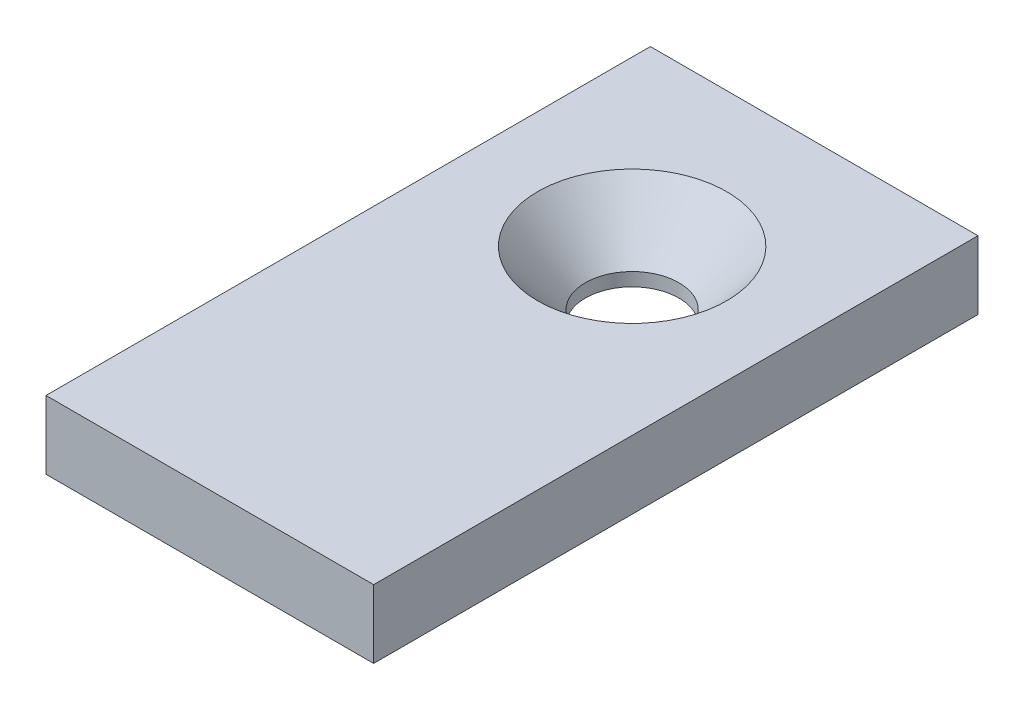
ISO-10303-21;
HEADER;
FILE_DESCRIPTION(('STEP AP214'),'2;1');
FILE_NAME('part.step','',(''),(''),'','','');
FILE_SCHEMA(('AUTOMOTIVE_DESIGN { 1 0 10303 214 1 1 1 1 }'));
ENDSEC;
DATA;
#1=APPLICATION_CONTEXT('core data for automotive mechanical design processes');
#2=APPLICATION_PROTOCOL_DEFINITION('international standard','automotive_design',2000,#1);
#3=PRODUCT_CONTEXT('',#1,'mechanical');
#4=PRODUCT('Part','Part','',(#3));
#5=PRODUCT_RELATED_PRODUCT_CATEGORY('part','',(#4));
#6=PRODUCT_DEFINITION_FORMATION('','',#4);
#7=PRODUCT_DEFINITION_CONTEXT('part definition',#1,'design');
#8=PRODUCT_DEFINITION('design','',#6,#7);
#9=PRODUCT_DEFINITION_SHAPE('','',#8);
#10=(LENGTH_UNIT() NAMED_UNIT(*) SI_UNIT(.MILLI.,.METRE.));
#11=(NAMED_UNIT(*) PLANE_ANGLE_UNIT() SI_UNIT($,.RADIAN.));
#12=(NAMED_UNIT(*) SI_UNIT($,.STERADIAN.) SOLID_ANGLE_UNIT());
#13=UNCERTAINTY_MEASURE_WITH_UNIT(LENGTH_MEASURE(1.E-05),#10,'distance_accuracy_value','');
#14=(GEOMETRIC_REPRESENTATION_CONTEXT(3) GLOBAL_UNCERTAINTY_ASSIGNED_CONTEXT((#13)) GLOBAL_UNIT_ASSIGNED_CONTEXT((#10,
#11,#12)) REPRESENTATION_CONTEXT('',''));
#15=CARTESIAN_POINT('',(0.,0.,0.));
#16=DIRECTION('',(0.,0.,1.));
#17=DIRECTION('',(1.,0.,0.));
#18=AXIS2_PLACEMENT_3D('',#15,#16,#17);
#19=CARTESIAN_POINT('',(0.,1.19062500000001,21.0819999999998));
#20=DIRECTION('',(1.,0.,0.));
#21=DIRECTION('',(0.,0.,-0.999999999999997));
#22=AXIS2_PLACEMENT_3D('',#19,#20,#21);
#23=PLANE('',#22);
#24=DIRECTION('',(0.,-0.999999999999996,0.));
#25=VECTOR('',#24,1.);
#26=CARTESIAN_POINT('',(0.,1.19062499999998,0.));
#27=LINE('',#26,#25);
#28=CARTESIAN_POINT('',(0.,1.19062499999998,0.));
#29=VERTEX_POINT('',#28);
#30=CARTESIAN_POINT('',(0.,-1.19062500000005,0.));
#31=VERTEX_POINT('',#30);
#32=EDGE_CURVE('E97',#29,#31,#27,.T.);
#33=ORIENTED_EDGE('',*,*,#32,.T.);
#34=DIRECTION('',(0.,0.,-0.999999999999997));
#35=VECTOR('',#34,1.);
#36=CARTESIAN_POINT('',(0.,-1.19062499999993,21.0819999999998));
#37=LINE('',#36,#35);
#38=CARTESIAN_POINT('',(0.,-1.19062499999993,21.0819999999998));
#39=VERTEX_POINT('',#38);
#40=EDGE_CURVE('E11',#39,#31,#37,.T.);
#41=ORIENTED_EDGE('',*,*,#40,.F.);
#42=DIRECTION('',(0.,-0.999999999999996,0.));
#43=VECTOR('',#42,1.);
#44=CARTESIAN_POINT('',(0.,1.19062500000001,21.0819999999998));
#45=LINE('',#44,#43);
#46=CARTESIAN_POINT('',(0.,1.19062500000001,21.0819999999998));
#47=VERTEX_POINT('',#46);
#48=EDGE_CURVE('E127',#47,#39,#45,.T.);
#49=ORIENTED_EDGE('',*,*,#48,.F.);
#50=DIRECTION('',(0.,0.,-0.999999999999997));
#51=VECTOR('',#50,1.);
#52=CARTESIAN_POINT('',(0.,1.19062500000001,21.0819999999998));
#53=LINE('',#52,#51);
#54=EDGE_CURVE('E110',#47,#29,#53,.T.);
#55=ORIENTED_EDGE('',*,*,#54,.T.);
#56=EDGE_LOOP('',(#33,#41,#49,#55));
#57=FACE_BOUND('',#56,.T.);
#58=ADVANCED_FACE('F44',(#57),#23,.F.);
#59=CARTESIAN_POINT('',(0.,-1.19062499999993,21.0819999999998));
#60=DIRECTION('',(0.,0.999999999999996,0.));
#61=DIRECTION('',(0.,0.,0.999999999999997));
#62=AXIS2_PLACEMENT_3D('',#59,#60,#61);
#63=PLANE('',#62);
#64=CARTESIAN_POINT('',(5.71500000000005,-1.19062499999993,6.35000000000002));
#65=DIRECTION('',(0.,0.999999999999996,0.));
#66=DIRECTION('',(0.,0.,0.999999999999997));
#67=AXIS2_PLACEMENT_3D('',#64,#65,#66);
#68=CIRCLE('',#67,1.63195);
#69=CARTESIAN_POINT('',(5.71500000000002,-1.19062499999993,7.98195000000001));
#70=VERTEX_POINT('',#69);
#71=EDGE_CURVE('E112',#70,#70,#68,.T.);
#72=ORIENTED_EDGE('',*,*,#71,.T.);
#73=EDGE_LOOP('',(#72));
#74=FACE_BOUND('',#73,.T.);
#75=DIRECTION('',(1.,0.,0.));
#76=VECTOR('',#75,1.);
#77=CARTESIAN_POINT('',(0.,-1.19062500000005,0.));
#78=LINE('',#77,#76);
#79=CARTESIAN_POINT('',(11.4300000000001,-1.19062500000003,0.));
#80=VERTEX_POINT('',#79);
#81=EDGE_CURVE('E93',#31,#80,#78,.T.);
#82=ORIENTED_EDGE('',*,*,#81,.T.);
#83=DIRECTION('',(0.,0.,-0.999999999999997));
#84=VECTOR('',#83,1.);
#85=CARTESIAN_POINT('',(11.4300000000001,-1.190625,21.0819999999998));
#86=LINE('',#85,#84);
#87=CARTESIAN_POINT('',(11.4300000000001,-1.190625,21.0819999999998));
#88=VERTEX_POINT('',#87);
#89=EDGE_CURVE('E52',#88,#80,#86,.T.);
#90=ORIENTED_EDGE('',*,*,#89,.F.);
#91=DIRECTION('',(1.,0.,0.));
#92=VECTOR('',#91,1.);
#93=CARTESIAN_POINT('',(0.,-1.19062499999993,21.0819999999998));
#94=LINE('',#93,#92);
#95=EDGE_CURVE('E106',#39,#88,#94,.T.);
#96=ORIENTED_EDGE('',*,*,#95,.F.);
#97=ORIENTED_EDGE('',*,*,#40,.T.);
#98=EDGE_LOOP('',(#82,#90,#96,#97));
#99=FACE_BOUND('',#98,.T.);
#100=ADVANCED_FACE('F105',(#74,#99),#63,.F.);
#101=CARTESIAN_POINT('',(11.4300000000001,1.19062500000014,21.0819999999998));
#102=DIRECTION('',(-1.,0.,0.));
#103=DIRECTION('',(0.,0.,0.999999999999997));
#104=AXIS2_PLACEMENT_3D('',#101,#102,#103);
#105=PLANE('',#104);
#106=DIRECTION('',(0.,0.999999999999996,0.));
#107=VECTOR('',#106,1.);
#108=CARTESIAN_POINT('',(11.4300000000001,1.19062499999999,0.));
#109=LINE('',#108,#107);
#110=CARTESIAN_POINT('',(11.4300000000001,1.19062499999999,0.));
#111=VERTEX_POINT('',#110);
#112=EDGE_CURVE('E98',#80,#111,#109,.T.);
#113=ORIENTED_EDGE('',*,*,#112,.T.);
#114=DIRECTION('',(0.,0.,-0.999999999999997));
#115=VECTOR('',#114,1.);
#116=CARTESIAN_POINT('',(11.4300000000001,1.19062500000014,21.0819999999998));
#117=LINE('',#116,#115);
#118=CARTESIAN_POINT('',(11.4300000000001,1.19062500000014,21.0819999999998));
#119=VERTEX_POINT('',#118);
#120=EDGE_CURVE('E136',#119,#111,#117,.T.);
#121=ORIENTED_EDGE('',*,*,#120,.F.);
#122=DIRECTION('',(0.,0.999999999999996,0.));
#123=VECTOR('',#122,1.);
#124=CARTESIAN_POINT('',(11.4300000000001,1.19062500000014,21.0819999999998));
#125=LINE('',#124,#123);
#126=EDGE_CURVE('E69',#88,#119,#125,.T.);
#127=ORIENTED_EDGE('',*,*,#126,.F.);
#128=ORIENTED_EDGE('',*,*,#89,.T.);
#129=EDGE_LOOP('',(#113,#121,#127,#128));
#130=FACE_BOUND('',#129,.T.);
#131=ADVANCED_FACE('F141',(#130),#105,.F.);
#132=CARTESIAN_POINT('',(0.,1.19062500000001,21.0819999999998));
#133=DIRECTION('',(0.,-0.999999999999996,0.));
#134=DIRECTION('',(1.,0.,0.));
#135=AXIS2_PLACEMENT_3D('',#132,#133,#134);
#136=PLANE('',#135);
#137=CARTESIAN_POINT('',(5.71500000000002,1.19062499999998,6.35000000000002));
#138=DIRECTION('',(0.,0.999999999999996,0.));
#139=DIRECTION('',(0.,0.,0.999999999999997));
#140=AXIS2_PLACEMENT_3D('',#137,#138,#139);
#141=CIRCLE('',#140,3.2990917);
#142=CARTESIAN_POINT('',(5.71500000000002,1.19062499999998,9.64909170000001));
#143=VERTEX_POINT('',#142);
#144=EDGE_CURVE('E174',#143,#143,#141,.T.);
#145=ORIENTED_EDGE('',*,*,#144,.F.);
#146=EDGE_LOOP('',(#145));
#147=FACE_BOUND('',#146,.T.);
#148=DIRECTION('',(-1.,0.,0.));
#149=VECTOR('',#148,1.);
#150=CARTESIAN_POINT('',(0.,1.19062499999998,0.));
#151=LINE('',#150,#149);
#152=EDGE_CURVE('E124',#111,#29,#151,.T.);
#153=ORIENTED_EDGE('',*,*,#152,.T.);
#154=ORIENTED_EDGE('',*,*,#54,.F.);
#155=DIRECTION('',(-1.,0.,0.));
#156=VECTOR('',#155,1.);
#157=CARTESIAN_POINT('',(0.,1.19062500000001,21.0819999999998));
#158=LINE('',#157,#156);
#159=EDGE_CURVE('E62',#119,#47,#158,.T.);
#160=ORIENTED_EDGE('',*,*,#159,.F.);
#161=ORIENTED_EDGE('',*,*,#120,.T.);
#162=EDGE_LOOP('',(#153,#154,#160,#161));
#163=FACE_BOUND('',#162,.T.);
#164=ADVANCED_FACE('F143',(#147,#163),#136,.F.);
#165=CARTESIAN_POINT('',(0.,-1.19062499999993,21.0819999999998));
#166=DIRECTION('',(0.,0.,0.999999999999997));
#167=DIRECTION('',(1.,0.,0.));
#168=AXIS2_PLACEMENT_3D('',#165,#166,#167);
#169=PLANE('',#168);
#170=ORIENTED_EDGE('',*,*,#48,.T.);
#171=ORIENTED_EDGE('',*,*,#95,.T.);
#172=ORIENTED_EDGE('',*,*,#126,.T.);
#173=ORIENTED_EDGE('',*,*,#159,.T.);
#174=EDGE_LOOP('',(#170,#171,#172,#173));
#175=FACE_BOUND('',#174,.T.);
#176=ADVANCED_FACE('F144',(#175),#169,.T.);
#177=CARTESIAN_POINT('',(0.,-1.19062500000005,0.));
#178=DIRECTION('',(0.,0.,0.999999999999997));
#179=DIRECTION('',(1.,0.,0.));
#180=AXIS2_PLACEMENT_3D('',#177,#178,#179);
#181=PLANE('',#180);
#182=ORIENTED_EDGE('',*,*,#32,.F.);
#183=ORIENTED_EDGE('',*,*,#152,.F.);
#184=ORIENTED_EDGE('',*,*,#112,.F.);
#185=ORIENTED_EDGE('',*,*,#81,.F.);
#186=EDGE_LOOP('',(#182,#183,#184,#185));
#187=FACE_BOUND('',#186,.T.);
#188=ADVANCED_FACE('F94',(#187),#181,.F.);
#189=CARTESIAN_POINT('',(5.71500000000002,1.19062499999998,6.35000000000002));
#190=DIRECTION('',(0.,0.999999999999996,0.));
#191=DIRECTION('',(0.,0.,0.999999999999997));
#192=AXIS2_PLACEMENT_3D('',#189,#190,#191);
#193=CYLINDRICAL_SURFACE('',#192,1.63195);
#194=CARTESIAN_POINT('',(5.71500000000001,-0.727202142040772,6.35));
#195=DIRECTION('',(0.,0.999999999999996,0.));
#196=DIRECTION('',(0.,0.,0.999999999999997));
#197=AXIS2_PLACEMENT_3D('',#194,#195,#196);
#198=CIRCLE('',#197,1.63195);
#199=CARTESIAN_POINT('',(5.71500000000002,-0.727202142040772,7.98195000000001));
#200=VERTEX_POINT('',#199);
#201=EDGE_CURVE('E118',#200,#200,#198,.T.);
#202=CARTESIAN_POINT('',(5.71500000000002,-1.19062499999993,7.98195000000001));
#203=CARTESIAN_POINT('',(5.71500000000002,-1.18579767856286,7.98195000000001));
#204=CARTESIAN_POINT('',(5.71500000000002,-1.18097035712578,7.98195000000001));
#205=CARTESIAN_POINT('',(5.71500000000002,-1.17131571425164,7.98195000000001));
#206=CARTESIAN_POINT('',(5.71500000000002,-1.16648839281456,7.98195000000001));
#207=CARTESIAN_POINT('',(5.71500000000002,-1.15683374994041,7.98195000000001));
#208=CARTESIAN_POINT('',(5.71500000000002,-1.15200642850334,7.98195000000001));
#209=CARTESIAN_POINT('',(5.71500000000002,-1.14235178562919,7.98195000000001));
#210=CARTESIAN_POINT('',(5.71500000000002,-1.13752446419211,7.98195000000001));
#211=CARTESIAN_POINT('',(5.71500000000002,-1.12786982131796,7.98195000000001));
#212=CARTESIAN_POINT('',(5.71500000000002,-1.12304249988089,7.98195000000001));
#213=CARTESIAN_POINT('',(5.71500000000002,-1.11338785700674,7.98195000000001));
#214=CARTESIAN_POINT('',(5.71500000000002,-1.10856053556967,7.98195000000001));
#215=CARTESIAN_POINT('',(5.71500000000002,-1.09890589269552,7.98195000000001));
#216=CARTESIAN_POINT('',(5.71500000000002,-1.09407857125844,7.98195000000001));
#217=CARTESIAN_POINT('',(5.71500000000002,-1.08442392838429,7.98195000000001));
#218=CARTESIAN_POINT('',(5.71500000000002,-1.07959660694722,7.98195000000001));
#219=CARTESIAN_POINT('',(5.71500000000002,-1.06994196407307,7.98195000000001));
#220=CARTESIAN_POINT('',(5.71500000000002,-1.06511464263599,7.98195000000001));
#221=CARTESIAN_POINT('',(5.71500000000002,-1.05545999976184,7.98195000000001));
#222=CARTESIAN_POINT('',(5.71500000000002,-1.05063267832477,7.98195000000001));
#223=CARTESIAN_POINT('',(5.71500000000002,-1.04097803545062,7.98195000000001));
#224=CARTESIAN_POINT('',(5.71500000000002,-1.03615071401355,7.98195000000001));
#225=CARTESIAN_POINT('',(5.71500000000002,-1.0264960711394,7.98195000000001));
#226=CARTESIAN_POINT('',(5.71500000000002,-1.02166874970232,7.98195000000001));
#227=CARTESIAN_POINT('',(5.71500000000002,-1.01201410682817,7.98195000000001));
#228=CARTESIAN_POINT('',(5.71500000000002,-1.0071867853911,7.98195000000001));
#229=CARTESIAN_POINT('',(5.71500000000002,-0.99753214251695,7.98195000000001));
#230=CARTESIAN_POINT('',(5.71500000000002,-0.992704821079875,7.98195000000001));
#231=CARTESIAN_POINT('',(5.71500000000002,-0.983050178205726,7.98195000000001));
#232=CARTESIAN_POINT('',(5.71500000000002,-0.978222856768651,7.98195000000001));
#233=CARTESIAN_POINT('',(5.71500000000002,-0.968568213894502,7.98195000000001));
#234=CARTESIAN_POINT('',(5.71500000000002,-0.963740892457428,7.98195000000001));
#235=CARTESIAN_POINT('',(5.71500000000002,-0.954086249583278,7.98195000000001));
#236=CARTESIAN_POINT('',(5.71500000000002,-0.949258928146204,7.98195000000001));
#237=CARTESIAN_POINT('',(5.71500000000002,-0.939604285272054,7.98195000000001));
#238=CARTESIAN_POINT('',(5.71500000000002,-0.93477696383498,7.98195000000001));
#239=CARTESIAN_POINT('',(5.71500000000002,-0.92512232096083,7.98195000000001));
#240=CARTESIAN_POINT('',(5.71500000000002,-0.920294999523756,7.98195000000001));
#241=CARTESIAN_POINT('',(5.71500000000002,-0.910640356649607,7.98195000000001));
#242=CARTESIAN_POINT('',(5.71500000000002,-0.905813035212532,7.98195000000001));
#243=CARTESIAN_POINT('',(5.71500000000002,-0.896158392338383,7.98195000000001));
#244=CARTESIAN_POINT('',(5.71500000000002,-0.891331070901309,7.98195000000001));
#245=CARTESIAN_POINT('',(5.71500000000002,-0.881676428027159,7.98195000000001));
#246=CARTESIAN_POINT('',(5.71500000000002,-0.876849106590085,7.98195000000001));
#247=CARTESIAN_POINT('',(5.71500000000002,-0.867194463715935,7.98195000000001));
#248=CARTESIAN_POINT('',(5.71500000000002,-0.862367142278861,7.98195000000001));
#249=CARTESIAN_POINT('',(5.71500000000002,-0.852712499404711,7.98195000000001));
#250=CARTESIAN_POINT('',(5.71500000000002,-0.847885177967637,7.98195000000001));
#251=CARTESIAN_POINT('',(5.71500000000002,-0.838230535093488,7.98195000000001));
#252=CARTESIAN_POINT('',(5.71500000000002,-0.833403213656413,7.98195000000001));
#253=CARTESIAN_POINT('',(5.71500000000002,-0.823748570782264,7.98195000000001));
#254=CARTESIAN_POINT('',(5.71500000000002,-0.818921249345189,7.98195000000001));
#255=CARTESIAN_POINT('',(5.71500000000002,-0.80926660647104,7.98195000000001));
#256=CARTESIAN_POINT('',(5.71500000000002,-0.804439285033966,7.98195000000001));
#257=CARTESIAN_POINT('',(5.71500000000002,-0.794784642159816,7.98195000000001));
#258=CARTESIAN_POINT('',(5.71500000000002,-0.789957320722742,7.98195000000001));
#259=CARTESIAN_POINT('',(5.71500000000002,-0.780302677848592,7.98195000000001));
#260=CARTESIAN_POINT('',(5.71500000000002,-0.775475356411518,7.98195000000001));
#261=CARTESIAN_POINT('',(5.71500000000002,-0.765820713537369,7.98195000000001));
#262=CARTESIAN_POINT('',(5.71500000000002,-0.760993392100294,7.98195000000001));
#263=CARTESIAN_POINT('',(5.71500000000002,-0.751338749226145,7.98195000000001));
#264=CARTESIAN_POINT('',(5.71500000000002,-0.74651142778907,7.98195000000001));
#265=CARTESIAN_POINT('',(5.71500000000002,-0.736856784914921,7.98195000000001));
#266=CARTESIAN_POINT('',(5.71500000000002,-0.732029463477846,7.98195000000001));
#267=CARTESIAN_POINT('',(5.71500000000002,-0.727202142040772,7.98195000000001));
#268=B_SPLINE_CURVE_WITH_KNOTS('',3,(#202,#203,#204,#205,#206,#207,#208,#209,#210,#211,#212,
#213,#214,#215,#216,#217,#218,#219,#220,#221,#222,#223,#224,#225,#226,#227,#228,#229,#230,#231,
#232,#233,#234,#235,#236,#237,#238,#239,#240,#241,#242,#243,#244,#245,#246,#247,#248,#249,#250,
#251,#252,#253,#254,#255,#256,#257,#258,#259,#260,#261,#262,#263,#264,#265,#266,#267),
.UNSPECIFIED.,.F.,.F.,(4,2,2,2,2,2,2,2,2,2,2,2,2,2,2,2,2,2,2,2,2,2,2,2,2,2,2,2,2,2,2,2,4),(0.,
0.014481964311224,0.0289639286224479,0.0434458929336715,0.0579278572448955,0.0724098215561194,
0.0868917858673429,0.101373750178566,0.11585571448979,0.130337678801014,0.144819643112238,
0.159301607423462,0.173783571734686,0.188265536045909,0.202747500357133,0.217229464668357,
0.231711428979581,0.246193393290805,0.260675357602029,0.275157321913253,0.289639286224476,
0.3041212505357,0.318603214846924,0.333085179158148,0.347567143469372,0.362049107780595,
0.376531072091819,0.391013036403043,0.405495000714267,0.419976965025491,0.434458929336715,
0.448940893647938,0.463422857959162),.UNSPECIFIED.);
#269=EDGE_CURVE('BSEAM151',#70,#200,#268,.T.);
#270=ORIENTED_EDGE('',*,*,#71,.F.);
#271=ORIENTED_EDGE('',*,*,#201,.T.);
#272=ORIENTED_EDGE('',*,*,#269,.T.);
#273=ORIENTED_EDGE('',*,*,#269,.F.);
#274=EDGE_LOOP('',(#270,#272,#271,#273));
#275=FACE_BOUND('',#274,.T.);
#276=ADVANCED_FACE('F151',(#275),#193,.F.);
#277=CARTESIAN_POINT('',(5.71500000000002,1.19062499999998,6.35000000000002));
#278=DIRECTION('',(0.,0.999999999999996,0.));
#279=DIRECTION('',(0.,0.,0.999999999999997));
#280=AXIS2_PLACEMENT_3D('',#277,#278,#279);
#281=CONICAL_SURFACE('',#280,3.2990917,0.715584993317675);
#282=CARTESIAN_POINT('',(5.71500000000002,-0.727202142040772,7.98194999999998));
#283=CARTESIAN_POINT('',(5.71500000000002,-0.707224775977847,7.99931605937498));
#284=CARTESIAN_POINT('',(5.71500000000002,-0.687247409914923,8.01668211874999));
#285=CARTESIAN_POINT('',(5.71500000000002,-0.647292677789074,8.05141423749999));
#286=CARTESIAN_POINT('',(5.71500000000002,-0.627315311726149,8.06878029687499));
#287=CARTESIAN_POINT('',(5.71500000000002,-0.5873605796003,8.10351241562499));
#288=CARTESIAN_POINT('',(5.71500000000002,-0.567383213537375,8.12087847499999));
#289=CARTESIAN_POINT('',(5.71500000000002,-0.527428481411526,8.15561059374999));
#290=CARTESIAN_POINT('',(5.71500000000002,-0.507451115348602,8.17297665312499));
#291=CARTESIAN_POINT('',(5.71500000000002,-0.467496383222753,8.20770877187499));
#292=CARTESIAN_POINT('',(5.71500000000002,-0.447519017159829,8.22507483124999));
#293=CARTESIAN_POINT('',(5.71500000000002,-0.40756428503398,8.25980694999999));
#294=CARTESIAN_POINT('',(5.71500000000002,-0.387586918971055,8.27717300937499));
#295=CARTESIAN_POINT('',(5.71500000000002,-0.347632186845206,8.31190512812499));
#296=CARTESIAN_POINT('',(5.71500000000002,-0.327654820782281,8.32927118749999));
#297=CARTESIAN_POINT('',(5.71500000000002,-0.287700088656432,8.36400330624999));
#298=CARTESIAN_POINT('',(5.71500000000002,-0.267722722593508,8.38136936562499));
#299=CARTESIAN_POINT('',(5.71500000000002,-0.227767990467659,8.41610148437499));
#300=CARTESIAN_POINT('',(5.71500000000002,-0.207790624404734,8.43346754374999));
#301=CARTESIAN_POINT('',(5.71500000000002,-0.167835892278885,8.46819966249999));
#302=CARTESIAN_POINT('',(5.71500000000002,-0.147858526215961,8.48556572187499));
#303=CARTESIAN_POINT('',(5.71500000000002,-0.107903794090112,8.52029784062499));
#304=CARTESIAN_POINT('',(5.71500000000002,-0.087926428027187,8.53766389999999));
#305=CARTESIAN_POINT('',(5.71500000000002,-0.0479716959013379,8.57239601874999));
#306=CARTESIAN_POINT('',(5.71500000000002,-0.0279943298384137,8.58976207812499));
#307=CARTESIAN_POINT('',(5.71500000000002,0.0119604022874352,8.62449419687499));
#308=CARTESIAN_POINT('',(5.71500000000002,0.0319377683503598,8.64186025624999));
#309=CARTESIAN_POINT('',(5.71500000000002,0.0718925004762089,8.67659237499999));
#310=CARTESIAN_POINT('',(5.71500000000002,0.0918698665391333,8.69395843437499));
#311=CARTESIAN_POINT('',(5.71500000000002,0.131824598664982,8.728690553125));
#312=CARTESIAN_POINT('',(5.71500000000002,0.151801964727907,8.74605661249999));
#313=CARTESIAN_POINT('',(5.71500000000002,0.191756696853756,8.78078873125));
#314=CARTESIAN_POINT('',(5.71500000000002,0.21173406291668,8.798154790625));
#315=CARTESIAN_POINT('',(5.71500000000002,0.251688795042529,8.832886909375));
#316=CARTESIAN_POINT('',(5.71500000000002,0.271666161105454,8.85025296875));
#317=CARTESIAN_POINT('',(5.71500000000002,0.311620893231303,8.8849850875));
#318=CARTESIAN_POINT('',(5.71500000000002,0.331598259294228,8.902351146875));
#319=CARTESIAN_POINT('',(5.71500000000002,0.371552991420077,8.937083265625));
#320=CARTESIAN_POINT('',(5.71500000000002,0.391530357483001,8.954449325));
#321=CARTESIAN_POINT('',(5.71500000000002,0.43148508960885,8.98918144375));
#322=CARTESIAN_POINT('',(5.71500000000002,0.451462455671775,9.006547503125));
#323=CARTESIAN_POINT('',(5.71500000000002,0.491417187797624,9.041279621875));
#324=CARTESIAN_POINT('',(5.71500000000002,0.511394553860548,9.05864568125));
#325=CARTESIAN_POINT('',(5.71500000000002,0.551349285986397,9.0933778));
#326=CARTESIAN_POINT('',(5.71500000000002,0.571326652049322,9.110743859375));
#327=CARTESIAN_POINT('',(5.71500000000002,0.611281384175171,9.145475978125));
#328=CARTESIAN_POINT('',(5.71500000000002,0.631258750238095,9.1628420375));
#329=CARTESIAN_POINT('',(5.71500000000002,0.671213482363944,9.19757415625));
#330=CARTESIAN_POINT('',(5.71500000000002,0.691190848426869,9.214940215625));
#331=CARTESIAN_POINT('',(5.71500000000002,0.731145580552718,9.249672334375));
#332=CARTESIAN_POINT('',(5.71500000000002,0.751122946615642,9.26703839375));
#333=CARTESIAN_POINT('',(5.71500000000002,0.791077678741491,9.3017705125));
#334=CARTESIAN_POINT('',(5.71500000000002,0.811055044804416,9.319136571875));
#335=CARTESIAN_POINT('',(5.71500000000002,0.851009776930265,9.353868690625));
#336=CARTESIAN_POINT('',(5.71500000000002,0.87098714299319,9.37123475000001));
#337=CARTESIAN_POINT('',(5.71500000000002,0.910941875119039,9.40596686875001));
#338=CARTESIAN_POINT('',(5.71500000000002,0.930919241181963,9.423332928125));
#339=CARTESIAN_POINT('',(5.71500000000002,0.970873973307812,9.45806504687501));
#340=CARTESIAN_POINT('',(5.71500000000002,0.990851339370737,9.47543110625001));
#341=CARTESIAN_POINT('',(5.71500000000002,1.03080607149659,9.51016322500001));
#342=CARTESIAN_POINT('',(5.71500000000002,1.05078343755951,9.52752928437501));
#343=CARTESIAN_POINT('',(5.71500000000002,1.09073816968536,9.56226140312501));
#344=CARTESIAN_POINT('',(5.71500000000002,1.11071553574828,9.57962746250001));
#345=CARTESIAN_POINT('',(5.71500000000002,1.15067026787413,9.61435958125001));
#346=CARTESIAN_POINT('',(5.71500000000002,1.17064763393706,9.63172564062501));
#347=CARTESIAN_POINT('',(5.71500000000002,1.19062499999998,9.64909170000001));
#348=B_SPLINE_CURVE_WITH_KNOTS('',3,(#282,#283,#284,#285,#286,#287,#288,#289,#290,#291,#292,
#293,#294,#295,#296,#297,#298,#299,#300,#301,#302,#303,#304,#305,#306,#307,#308,#309,#310,#311,
#312,#313,#314,#315,#316,#317,#318,#319,#320,#321,#322,#323,#324,#325,#326,#327,#328,#329,#330,
#331,#332,#333,#334,#335,#336,#337,#338,#339,#340,#341,#342,#343,#344,#345,#346,#347),
.UNSPECIFIED.,.F.,.F.,(4,2,2,2,2,2,2,2,2,2,2,2,2,2,2,2,2,2,2,2,2,2,2,2,2,2,2,2,2,2,2,2,4),(0.,
0.0794108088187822,0.158821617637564,0.238232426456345,0.317643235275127,0.397054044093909,
0.47646485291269,0.555875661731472,0.635286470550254,0.714697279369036,0.794108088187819,
0.8735188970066,0.952929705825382,1.03234051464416,1.11175132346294,1.19116213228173,
1.27057294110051,1.34998374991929,1.42939455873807,1.50880536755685,1.58821617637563,
1.66762698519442,1.7470377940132,1.82644860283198,1.90585941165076,1.98527022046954,
2.06468102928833,2.14409183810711,2.22350264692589,2.30291345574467,2.38232426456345,
2.46173507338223,2.54114588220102),.UNSPECIFIED.);
#349=EDGE_CURVE('BSEAM168',#200,#143,#348,.T.);
#350=ORIENTED_EDGE('',*,*,#201,.F.);
#351=ORIENTED_EDGE('',*,*,#144,.T.);
#352=ORIENTED_EDGE('',*,*,#349,.T.);
#353=ORIENTED_EDGE('',*,*,#349,.F.);
#354=EDGE_LOOP('',(#350,#352,#351,#353));
#355=FACE_BOUND('',#354,.T.);
#356=ADVANCED_FACE('F168',(#355),#281,.F.);
#357=CLOSED_SHELL('',(#58,#100,#131,#164,#176,#188,#276,#356));
#358=MANIFOLD_SOLID_BREP('B2',#357);
#359=ADVANCED_BREP_SHAPE_REPRESENTATION('',(#18,#358),#14);
#360=SHAPE_DEFINITION_REPRESENTATION(#9,#359);
ENDSEC;
END-ISO-10303-21;
